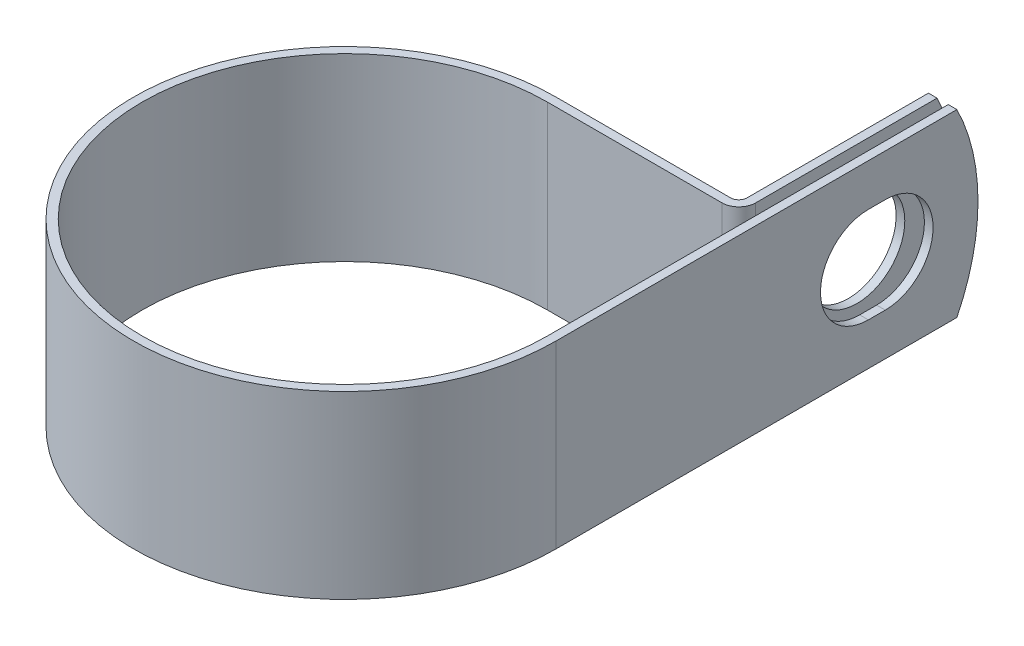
ISO-10303-21;
HEADER;
FILE_DESCRIPTION(('STEP AP214'),'2;1');
FILE_NAME('part.step','',(''),(''),'','','');
FILE_SCHEMA(('AUTOMOTIVE_DESIGN { 1 0 10303 214 1 1 1 1 }'));
ENDSEC;
DATA;
#1=APPLICATION_CONTEXT('core data for automotive mechanical design processes');
#2=APPLICATION_PROTOCOL_DEFINITION('international standard','automotive_design',2000,#1);
#3=PRODUCT_CONTEXT('',#1,'mechanical');
#4=PRODUCT('Part','Part','',(#3));
#5=PRODUCT_RELATED_PRODUCT_CATEGORY('part','',(#4));
#6=PRODUCT_DEFINITION_FORMATION('','',#4);
#7=PRODUCT_DEFINITION_CONTEXT('part definition',#1,'design');
#8=PRODUCT_DEFINITION('design','',#6,#7);
#9=PRODUCT_DEFINITION_SHAPE('','',#8);
#10=(LENGTH_UNIT() NAMED_UNIT(*) SI_UNIT(.MILLI.,.METRE.));
#11=(NAMED_UNIT(*) PLANE_ANGLE_UNIT() SI_UNIT($,.RADIAN.));
#12=(NAMED_UNIT(*) SI_UNIT($,.STERADIAN.) SOLID_ANGLE_UNIT());
#13=UNCERTAINTY_MEASURE_WITH_UNIT(LENGTH_MEASURE(1.E-05),#10,'distance_accuracy_value','');
#14=(GEOMETRIC_REPRESENTATION_CONTEXT(3) GLOBAL_UNCERTAINTY_ASSIGNED_CONTEXT((#13)) GLOBAL_UNIT_ASSIGNED_CONTEXT((#10,
#11,#12)) REPRESENTATION_CONTEXT('',''));
#15=CARTESIAN_POINT('',(0.,0.,0.));
#16=DIRECTION('',(0.,0.,1.));
#17=DIRECTION('',(1.,0.,0.));
#18=AXIS2_PLACEMENT_3D('',#15,#16,#17);
#19=CARTESIAN_POINT('',(28.575,12.7,0.));
#20=DIRECTION('',(-1.,0.,0.));
#21=DIRECTION('',(0.,0.,1.));
#22=AXIS2_PLACEMENT_3D('',#19,#20,#21);
#23=PLANE('',#22);
#24=DIRECTION('',(0.,0.,-1.));
#25=VECTOR('',#24,1.);
#26=CARTESIAN_POINT('',(28.575,-6.7437,-44.0435999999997));
#27=LINE('',#26,#25);
#28=CARTESIAN_POINT('',(28.575,-6.7437,-44.0435999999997));
#29=VERTEX_POINT('',#28);
#30=CARTESIAN_POINT('',(28.575,-6.7437,-46.4312000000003));
#31=VERTEX_POINT('',#30);
#32=EDGE_CURVE('E236',#29,#31,#27,.T.);
#33=ORIENTED_EDGE('',*,*,#32,.T.);
#34=CARTESIAN_POINT('',(28.575,0.,-46.4311999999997));
#35=DIRECTION('',(-1.,0.,0.));
#36=DIRECTION('',(0.,0.,1.));
#37=AXIS2_PLACEMENT_3D('',#34,#35,#36);
#38=CIRCLE('',#37,6.7437);
#39=CARTESIAN_POINT('',(28.575,6.7437,-46.4312000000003));
#40=VERTEX_POINT('',#39);
#41=EDGE_CURVE('E257',#31,#40,#38,.F.);
#42=ORIENTED_EDGE('',*,*,#41,.T.);
#43=DIRECTION('',(0.,0.,1.));
#44=VECTOR('',#43,1.);
#45=CARTESIAN_POINT('',(28.575,6.7437,-44.0435999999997));
#46=LINE('',#45,#44);
#47=CARTESIAN_POINT('',(28.575,6.7437,-44.0435999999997));
#48=VERTEX_POINT('',#47);
#49=EDGE_CURVE('E253',#40,#48,#46,.T.);
#50=ORIENTED_EDGE('',*,*,#49,.T.);
#51=CARTESIAN_POINT('',(28.575,0.,-44.0435999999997));
#52=DIRECTION('',(-1.,0.,0.));
#53=DIRECTION('',(0.,0.,1.));
#54=AXIS2_PLACEMENT_3D('',#51,#52,#53);
#55=CIRCLE('',#54,6.7437);
#56=EDGE_CURVE('E248',#48,#29,#55,.F.);
#57=ORIENTED_EDGE('',*,*,#56,.T.);
#58=EDGE_LOOP('',(#33,#42,#50,#57));
#59=FACE_BOUND('',#58,.T.);
#60=CARTESIAN_POINT('',(28.575,0.,-30.9372));
#61=DIRECTION('',(-1.,0.,0.));
#62=DIRECTION('',(0.,0.,1.));
#63=AXIS2_PLACEMENT_3D('',#60,#61,#62);
#64=CIRCLE('',#63,28.575);
#65=CARTESIAN_POINT('',(28.575,12.7,-56.5348683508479));
#66=VERTEX_POINT('',#65);
#67=CARTESIAN_POINT('',(28.575,-12.7,-56.5348683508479));
#68=VERTEX_POINT('',#67);
#69=EDGE_CURVE('E75',#66,#68,#64,.T.);
#70=ORIENTED_EDGE('',*,*,#69,.T.);
#71=DIRECTION('',(0.,0.,-1.));
#72=VECTOR('',#71,1.);
#73=CARTESIAN_POINT('',(28.575,-12.7,0.));
#74=LINE('',#73,#72);
#75=CARTESIAN_POINT('',(28.575,-12.7,0.));
#76=VERTEX_POINT('',#75);
#77=EDGE_CURVE('E271',#76,#68,#74,.T.);
#78=ORIENTED_EDGE('',*,*,#77,.F.);
#79=DIRECTION('',(0.,-1.,0.));
#80=VECTOR('',#79,1.);
#81=CARTESIAN_POINT('',(28.575,12.7,0.));
#82=LINE('',#81,#80);
#83=CARTESIAN_POINT('',(28.575,12.7,0.));
#84=VERTEX_POINT('',#83);
#85=EDGE_CURVE('E218',#84,#76,#82,.T.);
#86=ORIENTED_EDGE('',*,*,#85,.F.);
#87=DIRECTION('',(0.,0.,-1.));
#88=VECTOR('',#87,1.);
#89=CARTESIAN_POINT('',(28.575,12.7,-28.575));
#90=LINE('',#89,#88);
#91=EDGE_CURVE('E273',#84,#66,#90,.T.);
#92=ORIENTED_EDGE('',*,*,#91,.T.);
#93=EDGE_LOOP('',(#70,#78,#86,#92));
#94=FACE_BOUND('',#93,.T.);
#95=ADVANCED_FACE('F54',(#59,#94),#23,.T.);
#96=CARTESIAN_POINT('',(27.0002,12.7,-59.5122));
#97=DIRECTION('',(1.,0.,0.));
#98=DIRECTION('',(0.,0.,-1.));
#99=AXIS2_PLACEMENT_3D('',#96,#97,#98);
#100=PLANE('',#99);
#101=CARTESIAN_POINT('',(27.0002,0.,-45.2374));
#102=DIRECTION('',(1.,0.,0.));
#103=DIRECTION('',(0.,0.,-1.));
#104=AXIS2_PLACEMENT_3D('',#101,#102,#103);
#105=CIRCLE('',#104,6.7437);
#106=CARTESIAN_POINT('',(27.0002,0.,-51.9811));
#107=VERTEX_POINT('',#106);
#108=EDGE_CURVE('E268',#107,#107,#105,.F.);
#109=ORIENTED_EDGE('',*,*,#108,.T.);
#110=EDGE_LOOP('',(#109));
#111=FACE_BOUND('',#110,.T.);
#112=DIRECTION('',(0.,0.,1.));
#113=VECTOR('',#112,1.);
#114=CARTESIAN_POINT('',(27.0002,-12.7,-59.5122));
#115=LINE('',#114,#113);
#116=CARTESIAN_POINT('',(27.0002,-12.7,-56.5348683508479));
#117=VERTEX_POINT('',#116);
#118=CARTESIAN_POINT('',(27.0002,-12.7,-30.95244));
#119=VERTEX_POINT('',#118);
#120=EDGE_CURVE('E184',#117,#119,#115,.T.);
#121=ORIENTED_EDGE('',*,*,#120,.F.);
#122=CARTESIAN_POINT('',(27.0002,0.,-30.9372));
#123=DIRECTION('',(1.,0.,0.));
#124=DIRECTION('',(0.,0.,-1.));
#125=AXIS2_PLACEMENT_3D('',#122,#123,#124);
#126=CIRCLE('',#125,28.575);
#127=CARTESIAN_POINT('',(27.0002,12.7,-56.5348683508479));
#128=VERTEX_POINT('',#127);
#129=EDGE_CURVE('E176',#117,#128,#126,.T.);
#130=ORIENTED_EDGE('',*,*,#129,.T.);
#131=DIRECTION('',(0.,0.,1.));
#132=VECTOR('',#131,1.);
#133=CARTESIAN_POINT('',(27.0002,12.7,-59.5122));
#134=LINE('',#133,#132);
#135=CARTESIAN_POINT('',(27.0002,12.7,-30.95244));
#136=VERTEX_POINT('',#135);
#137=EDGE_CURVE('E224',#128,#136,#134,.T.);
#138=ORIENTED_EDGE('',*,*,#137,.T.);
#139=DIRECTION('',(0.,-1.,0.));
#140=VECTOR('',#139,1.);
#141=CARTESIAN_POINT('',(27.0002,12.7,-30.95244));
#142=LINE('',#141,#140);
#143=EDGE_CURVE('E211',#136,#119,#142,.T.);
#144=ORIENTED_EDGE('',*,*,#143,.T.);
#145=EDGE_LOOP('',(#121,#130,#138,#144));
#146=FACE_BOUND('',#145,.T.);
#147=ADVANCED_FACE('F226',(#111,#146),#100,.T.);
#148=CARTESIAN_POINT('',(25.781,12.7,-59.5122));
#149=DIRECTION('',(1.,0.,0.));
#150=DIRECTION('',(0.,0.,-1.));
#151=AXIS2_PLACEMENT_3D('',#148,#149,#150);
#152=PLANE('',#151);
#153=CARTESIAN_POINT('',(25.781,0.,-45.2374));
#154=DIRECTION('',(-1.,0.,0.));
#155=DIRECTION('',(0.,0.,1.));
#156=AXIS2_PLACEMENT_3D('',#153,#154,#155);
#157=CIRCLE('',#156,6.7437);
#158=CARTESIAN_POINT('',(25.781,0.,-38.4937));
#159=VERTEX_POINT('',#158);
#160=EDGE_CURVE('E265',#159,#159,#157,.T.);
#161=ORIENTED_EDGE('',*,*,#160,.F.);
#162=EDGE_LOOP('',(#161));
#163=FACE_BOUND('',#162,.T.);
#164=CARTESIAN_POINT('',(25.781,0.,-30.9372));
#165=DIRECTION('',(-1.,0.,0.));
#166=DIRECTION('',(0.,0.,1.));
#167=AXIS2_PLACEMENT_3D('',#164,#165,#166);
#168=CIRCLE('',#167,28.575);
#169=CARTESIAN_POINT('',(25.781,12.7,-56.5348683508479));
#170=VERTEX_POINT('',#169);
#171=CARTESIAN_POINT('',(25.781,-12.7,-56.5348683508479));
#172=VERTEX_POINT('',#171);
#173=EDGE_CURVE('E67',#170,#172,#168,.T.);
#174=ORIENTED_EDGE('',*,*,#173,.T.);
#175=DIRECTION('',(0.,0.,1.));
#176=VECTOR('',#175,1.);
#177=CARTESIAN_POINT('',(25.781,-12.7,-59.5122));
#178=LINE('',#177,#176);
#179=CARTESIAN_POINT('',(25.781,-12.7,-30.95244));
#180=VERTEX_POINT('',#179);
#181=EDGE_CURVE('E167',#172,#180,#178,.T.);
#182=ORIENTED_EDGE('',*,*,#181,.T.);
#183=DIRECTION('',(0.,-1.,0.));
#184=VECTOR('',#183,1.);
#185=CARTESIAN_POINT('',(25.781,12.7,-30.95244));
#186=LINE('',#185,#184);
#187=CARTESIAN_POINT('',(25.781,12.7,-30.95244));
#188=VERTEX_POINT('',#187);
#189=EDGE_CURVE('E209',#188,#180,#186,.T.);
#190=ORIENTED_EDGE('',*,*,#189,.F.);
#191=DIRECTION('',(0.,0.,1.));
#192=VECTOR('',#191,1.);
#193=CARTESIAN_POINT('',(25.781,12.7,-59.5122));
#194=LINE('',#193,#192);
#195=EDGE_CURVE('E169',#170,#188,#194,.T.);
#196=ORIENTED_EDGE('',*,*,#195,.F.);
#197=EDGE_LOOP('',(#174,#182,#190,#196));
#198=FACE_BOUND('',#197,.T.);
#199=ADVANCED_FACE('F164',(#163,#198),#152,.F.);
#200=CARTESIAN_POINT('',(29.7942,12.7,0.));
#201=DIRECTION('',(-1.,0.,0.));
#202=DIRECTION('',(0.,0.,1.));
#203=AXIS2_PLACEMENT_3D('',#200,#201,#202);
#204=PLANE('',#203);
#205=CARTESIAN_POINT('',(29.7942,0.,-46.4311999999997));
#206=DIRECTION('',(1.,0.,0.));
#207=DIRECTION('',(0.,0.,-1.));
#208=AXIS2_PLACEMENT_3D('',#205,#206,#207);
#209=CIRCLE('',#208,6.7437);
#210=CARTESIAN_POINT('',(29.7942,-6.7437,-46.4312000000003));
#211=VERTEX_POINT('',#210);
#212=CARTESIAN_POINT('',(29.7942,6.7437,-46.4312000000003));
#213=VERTEX_POINT('',#212);
#214=EDGE_CURVE('E237',#211,#213,#209,.T.);
#215=ORIENTED_EDGE('',*,*,#214,.F.);
#216=DIRECTION('',(0.,0.,-1.));
#217=VECTOR('',#216,1.);
#218=CARTESIAN_POINT('',(29.7942,-6.7437,-44.0435999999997));
#219=LINE('',#218,#217);
#220=CARTESIAN_POINT('',(29.7942,-6.7437,-44.0435999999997));
#221=VERTEX_POINT('',#220);
#222=EDGE_CURVE('E240',#221,#211,#219,.T.);
#223=ORIENTED_EDGE('',*,*,#222,.F.);
#224=CARTESIAN_POINT('',(29.7942,0.,-44.0435999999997));
#225=DIRECTION('',(1.,0.,0.));
#226=DIRECTION('',(0.,0.,-1.));
#227=AXIS2_PLACEMENT_3D('',#224,#225,#226);
#228=CIRCLE('',#227,6.7437);
#229=CARTESIAN_POINT('',(29.7942,6.7437,-44.0435999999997));
#230=VERTEX_POINT('',#229);
#231=EDGE_CURVE('E230',#230,#221,#228,.T.);
#232=ORIENTED_EDGE('',*,*,#231,.F.);
#233=DIRECTION('',(0.,0.,1.));
#234=VECTOR('',#233,1.);
#235=CARTESIAN_POINT('',(29.7942,6.7437,-44.0435999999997));
#236=LINE('',#235,#234);
#237=EDGE_CURVE('E234',#213,#230,#236,.T.);
#238=ORIENTED_EDGE('',*,*,#237,.F.);
#239=EDGE_LOOP('',(#215,#223,#232,#238));
#240=FACE_BOUND('',#239,.T.);
#241=DIRECTION('',(0.,0.,-1.));
#242=VECTOR('',#241,1.);
#243=CARTESIAN_POINT('',(29.7942,-12.7,0.));
#244=LINE('',#243,#242);
#245=CARTESIAN_POINT('',(29.7942,-12.7,0.));
#246=VERTEX_POINT('',#245);
#247=CARTESIAN_POINT('',(29.7942,-12.7,-56.5348683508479));
#248=VERTEX_POINT('',#247);
#249=EDGE_CURVE('E195',#246,#248,#244,.T.);
#250=ORIENTED_EDGE('',*,*,#249,.T.);
#251=CARTESIAN_POINT('',(29.7942,0.,-30.9372));
#252=DIRECTION('',(-1.,0.,0.));
#253=DIRECTION('',(0.,0.,1.));
#254=AXIS2_PLACEMENT_3D('',#251,#252,#253);
#255=CIRCLE('',#254,28.575);
#256=CARTESIAN_POINT('',(29.7942,12.7,-56.5348683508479));
#257=VERTEX_POINT('',#256);
#258=EDGE_CURVE('E170',#257,#248,#255,.T.);
#259=ORIENTED_EDGE('',*,*,#258,.F.);
#260=DIRECTION('',(0.,0.,-1.));
#261=VECTOR('',#260,1.);
#262=CARTESIAN_POINT('',(29.7942,12.7,-28.575));
#263=LINE('',#262,#261);
#264=CARTESIAN_POINT('',(29.7942,12.7,0.));
#265=VERTEX_POINT('',#264);
#266=EDGE_CURVE('E198',#265,#257,#263,.T.);
#267=ORIENTED_EDGE('',*,*,#266,.F.);
#268=DIRECTION('',(0.,-1.,0.));
#269=VECTOR('',#268,1.);
#270=CARTESIAN_POINT('',(29.7942,12.7,0.));
#271=LINE('',#270,#269);
#272=EDGE_CURVE('E199',#265,#246,#271,.T.);
#273=ORIENTED_EDGE('',*,*,#272,.T.);
#274=EDGE_LOOP('',(#250,#259,#267,#273));
#275=FACE_BOUND('',#274,.T.);
#276=ADVANCED_FACE('F321',(#240,#275),#204,.F.);
#277=CARTESIAN_POINT('',(0.,-12.7,0.));
#278=DIRECTION('',(0.,1.,0.));
#279=DIRECTION('',(1.,0.,0.));
#280=AXIS2_PLACEMENT_3D('',#277,#278,#279);
#281=PLANE('',#280);
#282=DIRECTION('',(-1.,0.,0.));
#283=VECTOR('',#282,1.);
#284=CARTESIAN_POINT('',(29.7942,-12.7,-56.5348683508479));
#285=LINE('',#284,#283);
#286=EDGE_CURVE('E171',#248,#68,#285,.T.);
#287=ORIENTED_EDGE('',*,*,#286,.F.);
#288=ORIENTED_EDGE('',*,*,#249,.F.);
#289=CARTESIAN_POINT('',(0.,-12.7,0.));
#290=DIRECTION('',(0.,1.,0.));
#291=DIRECTION('',(1.,0.,0.));
#292=AXIS2_PLACEMENT_3D('',#289,#290,#291);
#293=CIRCLE('',#292,29.7942);
#294=CARTESIAN_POINT('',(0.,-12.7,-29.7942));
#295=VERTEX_POINT('',#294);
#296=EDGE_CURVE('E193',#295,#246,#293,.T.);
#297=ORIENTED_EDGE('',*,*,#296,.F.);
#298=DIRECTION('',(1.,0.,0.));
#299=VECTOR('',#298,1.);
#300=CARTESIAN_POINT('',(0.,-12.7,-29.7942));
#301=LINE('',#300,#299);
#302=CARTESIAN_POINT('',(24.62276,-12.7,-29.7942));
#303=VERTEX_POINT('',#302);
#304=EDGE_CURVE('E186',#303,#295,#301,.F.);
#305=ORIENTED_EDGE('',*,*,#304,.F.);
#306=CARTESIAN_POINT('',(24.62276,-12.7,-30.95244));
#307=DIRECTION('',(0.,1.,0.));
#308=DIRECTION('',(1.,0.,0.));
#309=AXIS2_PLACEMENT_3D('',#306,#307,#308);
#310=CIRCLE('',#309,1.15824);
#311=EDGE_CURVE('E183',#180,#303,#310,.F.);
#312=ORIENTED_EDGE('',*,*,#311,.F.);
#313=ORIENTED_EDGE('',*,*,#181,.F.);
#314=DIRECTION('',(-1.,0.,0.));
#315=VECTOR('',#314,1.);
#316=CARTESIAN_POINT('',(29.7942,-12.7,-56.5348683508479));
#317=LINE('',#316,#315);
#318=EDGE_CURVE('E12',#117,#172,#317,.T.);
#319=ORIENTED_EDGE('',*,*,#318,.F.);
#320=ORIENTED_EDGE('',*,*,#120,.T.);
#321=CARTESIAN_POINT('',(24.62276,-12.7,-30.95244));
#322=DIRECTION('',(0.,-1.,0.));
#323=DIRECTION('',(0.,0.,1.));
#324=AXIS2_PLACEMENT_3D('',#321,#322,#323);
#325=CIRCLE('',#324,2.37744);
#326=CARTESIAN_POINT('',(24.62276,-12.7,-28.575));
#327=VERTEX_POINT('',#326);
#328=EDGE_CURVE('E188',#119,#327,#325,.T.);
#329=ORIENTED_EDGE('',*,*,#328,.T.);
#330=DIRECTION('',(-1.,0.,0.));
#331=VECTOR('',#330,1.);
#332=CARTESIAN_POINT('',(0.,-12.7,-28.575));
#333=LINE('',#332,#331);
#334=CARTESIAN_POINT('',(0.,-12.7,-28.575));
#335=VERTEX_POINT('',#334);
#336=EDGE_CURVE('E298',#327,#335,#333,.T.);
#337=ORIENTED_EDGE('',*,*,#336,.T.);
#338=CARTESIAN_POINT('',(0.,-12.7,0.));
#339=DIRECTION('',(0.,1.,0.));
#340=DIRECTION('',(0.,0.,1.));
#341=AXIS2_PLACEMENT_3D('',#338,#339,#340);
#342=CIRCLE('',#341,28.575);
#343=EDGE_CURVE('E295',#335,#76,#342,.T.);
#344=ORIENTED_EDGE('',*,*,#343,.T.);
#345=ORIENTED_EDGE('',*,*,#77,.T.);
#346=EDGE_LOOP('',(#287,#288,#297,#305,#312,#313,#319,#320,#329,#337,#344,#345));
#347=FACE_BOUND('',#346,.T.);
#348=ADVANCED_FACE('F181',(#347),#281,.F.);
#349=CARTESIAN_POINT('',(0.,12.7,0.));
#350=DIRECTION('',(0.,1.,0.));
#351=DIRECTION('',(1.,0.,0.));
#352=AXIS2_PLACEMENT_3D('',#349,#350,#351);
#353=PLANE('',#352);
#354=ORIENTED_EDGE('',*,*,#266,.T.);
#355=DIRECTION('',(-1.,0.,0.));
#356=VECTOR('',#355,1.);
#357=CARTESIAN_POINT('',(29.7942,12.7,-56.5348683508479));
#358=LINE('',#357,#356);
#359=EDGE_CURVE('E228',#257,#66,#358,.T.);
#360=ORIENTED_EDGE('',*,*,#359,.T.);
#361=ORIENTED_EDGE('',*,*,#91,.F.);
#362=CARTESIAN_POINT('',(0.,12.7,0.));
#363=DIRECTION('',(0.,1.,0.));
#364=DIRECTION('',(0.,0.,1.));
#365=AXIS2_PLACEMENT_3D('',#362,#363,#364);
#366=CIRCLE('',#365,28.575);
#367=CARTESIAN_POINT('',(0.,12.7,-28.575));
#368=VERTEX_POINT('',#367);
#369=EDGE_CURVE('E276',#368,#84,#366,.T.);
#370=ORIENTED_EDGE('',*,*,#369,.F.);
#371=DIRECTION('',(-1.,0.,0.));
#372=VECTOR('',#371,1.);
#373=CARTESIAN_POINT('',(0.,12.7,-28.575));
#374=LINE('',#373,#372);
#375=CARTESIAN_POINT('',(24.62276,12.7,-28.575));
#376=VERTEX_POINT('',#375);
#377=EDGE_CURVE('E279',#376,#368,#374,.T.);
#378=ORIENTED_EDGE('',*,*,#377,.F.);
#379=CARTESIAN_POINT('',(24.62276,12.7,-30.95244));
#380=DIRECTION('',(0.,-1.,0.));
#381=DIRECTION('',(0.,0.,1.));
#382=AXIS2_PLACEMENT_3D('',#379,#380,#381);
#383=CIRCLE('',#382,2.37744);
#384=EDGE_CURVE('E282',#136,#376,#383,.T.);
#385=ORIENTED_EDGE('',*,*,#384,.F.);
#386=ORIENTED_EDGE('',*,*,#137,.F.);
#387=DIRECTION('',(-1.,0.,0.));
#388=VECTOR('',#387,1.);
#389=CARTESIAN_POINT('',(29.7942,12.7,-56.5348683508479));
#390=LINE('',#389,#388);
#391=EDGE_CURVE('E61',#128,#170,#390,.T.);
#392=ORIENTED_EDGE('',*,*,#391,.T.);
#393=ORIENTED_EDGE('',*,*,#195,.T.);
#394=CARTESIAN_POINT('',(24.62276,12.7,-30.95244));
#395=DIRECTION('',(0.,1.,0.));
#396=DIRECTION('',(1.,0.,0.));
#397=AXIS2_PLACEMENT_3D('',#394,#395,#396);
#398=CIRCLE('',#397,1.15824);
#399=CARTESIAN_POINT('',(24.62276,12.7,-29.7942));
#400=VERTEX_POINT('',#399);
#401=EDGE_CURVE('E287',#188,#400,#398,.F.);
#402=ORIENTED_EDGE('',*,*,#401,.T.);
#403=DIRECTION('',(1.,0.,0.));
#404=VECTOR('',#403,1.);
#405=CARTESIAN_POINT('',(0.,12.7,-29.7942));
#406=LINE('',#405,#404);
#407=CARTESIAN_POINT('',(0.,12.7,-29.7942));
#408=VERTEX_POINT('',#407);
#409=EDGE_CURVE('E289',#400,#408,#406,.F.);
#410=ORIENTED_EDGE('',*,*,#409,.T.);
#411=CARTESIAN_POINT('',(0.,12.7,0.));
#412=DIRECTION('',(0.,1.,0.));
#413=DIRECTION('',(1.,0.,0.));
#414=AXIS2_PLACEMENT_3D('',#411,#412,#413);
#415=CIRCLE('',#414,29.7942);
#416=EDGE_CURVE('E203',#408,#265,#415,.T.);
#417=ORIENTED_EDGE('',*,*,#416,.T.);
#418=EDGE_LOOP('',(#354,#360,#361,#370,#378,#385,#386,#392,#393,#402,#410,#417));
#419=FACE_BOUND('',#418,.T.);
#420=ADVANCED_FACE('F222',(#419),#353,.T.);
#421=CARTESIAN_POINT('',(0.,12.7,0.));
#422=DIRECTION('',(0.,-1.,0.));
#423=DIRECTION('',(0.,0.,-1.));
#424=AXIS2_PLACEMENT_3D('',#421,#422,#423);
#425=CYLINDRICAL_SURFACE('',#424,28.575);
#426=ORIENTED_EDGE('',*,*,#343,.F.);
#427=DIRECTION('',(0.,-1.,0.));
#428=VECTOR('',#427,1.);
#429=CARTESIAN_POINT('',(0.,12.7,-28.575));
#430=LINE('',#429,#428);
#431=EDGE_CURVE('E216',#368,#335,#430,.T.);
#432=ORIENTED_EDGE('',*,*,#431,.F.);
#433=ORIENTED_EDGE('',*,*,#369,.T.);
#434=ORIENTED_EDGE('',*,*,#85,.T.);
#435=EDGE_LOOP('',(#426,#432,#433,#434));
#436=FACE_BOUND('',#435,.T.);
#437=ADVANCED_FACE('F311',(#436),#425,.F.);
#438=CARTESIAN_POINT('',(0.,12.7,-28.575));
#439=DIRECTION('',(0.,0.,1.));
#440=DIRECTION('',(1.,0.,0.));
#441=AXIS2_PLACEMENT_3D('',#438,#439,#440);
#442=PLANE('',#441);
#443=ORIENTED_EDGE('',*,*,#336,.F.);
#444=DIRECTION('',(0.,-1.,0.));
#445=VECTOR('',#444,1.);
#446=CARTESIAN_POINT('',(24.62276,12.7,-28.575));
#447=LINE('',#446,#445);
#448=EDGE_CURVE('E214',#376,#327,#447,.T.);
#449=ORIENTED_EDGE('',*,*,#448,.F.);
#450=ORIENTED_EDGE('',*,*,#377,.T.);
#451=ORIENTED_EDGE('',*,*,#431,.T.);
#452=EDGE_LOOP('',(#443,#449,#450,#451));
#453=FACE_BOUND('',#452,.T.);
#454=ADVANCED_FACE('F307',(#453),#442,.T.);
#455=CARTESIAN_POINT('',(24.62276,12.7,-30.95244));
#456=DIRECTION('',(0.,-1.,0.));
#457=DIRECTION('',(0.,0.,-1.));
#458=AXIS2_PLACEMENT_3D('',#455,#456,#457);
#459=CYLINDRICAL_SURFACE('',#458,2.37744);
#460=ORIENTED_EDGE('',*,*,#328,.F.);
#461=ORIENTED_EDGE('',*,*,#143,.F.);
#462=ORIENTED_EDGE('',*,*,#384,.T.);
#463=ORIENTED_EDGE('',*,*,#448,.T.);
#464=EDGE_LOOP('',(#460,#461,#462,#463));
#465=FACE_BOUND('',#464,.T.);
#466=ADVANCED_FACE('F304',(#465),#459,.T.);
#467=CARTESIAN_POINT('',(24.62276,12.7,-30.95244));
#468=DIRECTION('',(0.,-1.,0.));
#469=DIRECTION('',(0.,0.,-1.));
#470=AXIS2_PLACEMENT_3D('',#467,#468,#469);
#471=CYLINDRICAL_SURFACE('',#470,1.15824);
#472=ORIENTED_EDGE('',*,*,#311,.T.);
#473=DIRECTION('',(0.,-1.,0.));
#474=VECTOR('',#473,1.);
#475=CARTESIAN_POINT('',(24.62276,12.7,-29.7942));
#476=LINE('',#475,#474);
#477=EDGE_CURVE('E206',#400,#303,#476,.T.);
#478=ORIENTED_EDGE('',*,*,#477,.F.);
#479=ORIENTED_EDGE('',*,*,#401,.F.);
#480=ORIENTED_EDGE('',*,*,#189,.T.);
#481=EDGE_LOOP('',(#472,#478,#479,#480));
#482=FACE_BOUND('',#481,.T.);
#483=ADVANCED_FACE('F334',(#482),#471,.F.);
#484=CARTESIAN_POINT('',(0.,12.7,-29.7942));
#485=DIRECTION('',(0.,0.,1.));
#486=DIRECTION('',(1.,0.,0.));
#487=AXIS2_PLACEMENT_3D('',#484,#485,#486);
#488=PLANE('',#487);
#489=ORIENTED_EDGE('',*,*,#304,.T.);
#490=DIRECTION('',(0.,-1.,0.));
#491=VECTOR('',#490,1.);
#492=CARTESIAN_POINT('',(0.,12.7,-29.7942));
#493=LINE('',#492,#491);
#494=EDGE_CURVE('E202',#408,#295,#493,.T.);
#495=ORIENTED_EDGE('',*,*,#494,.F.);
#496=ORIENTED_EDGE('',*,*,#409,.F.);
#497=ORIENTED_EDGE('',*,*,#477,.T.);
#498=EDGE_LOOP('',(#489,#495,#496,#497));
#499=FACE_BOUND('',#498,.T.);
#500=ADVANCED_FACE('F330',(#499),#488,.F.);
#501=CARTESIAN_POINT('',(0.,12.7,0.));
#502=DIRECTION('',(0.,-1.,0.));
#503=DIRECTION('',(0.,0.,-1.));
#504=AXIS2_PLACEMENT_3D('',#501,#502,#503);
#505=CYLINDRICAL_SURFACE('',#504,29.7942);
#506=ORIENTED_EDGE('',*,*,#296,.T.);
#507=ORIENTED_EDGE('',*,*,#272,.F.);
#508=ORIENTED_EDGE('',*,*,#416,.F.);
#509=ORIENTED_EDGE('',*,*,#494,.T.);
#510=EDGE_LOOP('',(#506,#507,#508,#509));
#511=FACE_BOUND('',#510,.T.);
#512=ADVANCED_FACE('F327',(#511),#505,.T.);
#513=CARTESIAN_POINT('',(46.0742640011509,0.,-45.2374));
#514=DIRECTION('',(-1.,0.,0.));
#515=DIRECTION('',(0.,0.,1.));
#516=AXIS2_PLACEMENT_3D('',#513,#514,#515);
#517=CYLINDRICAL_SURFACE('',#516,6.7437);
#518=ORIENTED_EDGE('',*,*,#160,.T.);
#519=EDGE_LOOP('',(#518));
#520=FACE_BOUND('',#519,.T.);
#521=ORIENTED_EDGE('',*,*,#108,.F.);
#522=EDGE_LOOP('',(#521));
#523=FACE_BOUND('',#522,.T.);
#524=ADVANCED_FACE('F379',(#520,#523),#517,.F.);
#525=CARTESIAN_POINT('',(7.7441194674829,-6.7437,-44.0435999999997));
#526=DIRECTION('',(0.,-1.,0.));
#527=DIRECTION('',(0.,0.,-1.));
#528=AXIS2_PLACEMENT_3D('',#525,#526,#527);
#529=PLANE('',#528);
#530=DIRECTION('',(1.,0.,0.));
#531=VECTOR('',#530,1.);
#532=CARTESIAN_POINT('',(7.7441194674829,-6.7437,-44.0435999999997));
#533=LINE('',#532,#531);
#534=EDGE_CURVE('E251',#29,#221,#533,.T.);
#535=ORIENTED_EDGE('',*,*,#534,.T.);
#536=ORIENTED_EDGE('',*,*,#222,.T.);
#537=DIRECTION('',(1.,0.,0.));
#538=VECTOR('',#537,1.);
#539=CARTESIAN_POINT('',(7.7441194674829,-6.7437,-46.4312000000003));
#540=LINE('',#539,#538);
#541=EDGE_CURVE('E247',#31,#211,#540,.T.);
#542=ORIENTED_EDGE('',*,*,#541,.F.);
#543=ORIENTED_EDGE('',*,*,#32,.F.);
#544=EDGE_LOOP('',(#535,#536,#542,#543));
#545=FACE_BOUND('',#544,.T.);
#546=ADVANCED_FACE('F354',(#545),#529,.F.);
#547=CARTESIAN_POINT('',(7.7441194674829,0.,-46.4311999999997));
#548=DIRECTION('',(1.,0.,0.));
#549=DIRECTION('',(0.,0.,-1.));
#550=AXIS2_PLACEMENT_3D('',#547,#548,#549);
#551=CYLINDRICAL_SURFACE('',#550,6.7437);
#552=ORIENTED_EDGE('',*,*,#541,.T.);
#553=ORIENTED_EDGE('',*,*,#214,.T.);
#554=DIRECTION('',(1.,0.,0.));
#555=VECTOR('',#554,1.);
#556=CARTESIAN_POINT('',(7.7441194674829,6.7437,-46.4312000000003));
#557=LINE('',#556,#555);
#558=EDGE_CURVE('E256',#40,#213,#557,.T.);
#559=ORIENTED_EDGE('',*,*,#558,.F.);
#560=ORIENTED_EDGE('',*,*,#41,.F.);
#561=EDGE_LOOP('',(#552,#553,#559,#560));
#562=FACE_BOUND('',#561,.T.);
#563=ADVANCED_FACE('F358',(#562),#551,.F.);
#564=CARTESIAN_POINT('',(7.7441194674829,6.7437,-44.0435999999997));
#565=DIRECTION('',(0.,1.,0.));
#566=DIRECTION('',(0.,0.,1.));
#567=AXIS2_PLACEMENT_3D('',#564,#565,#566);
#568=PLANE('',#567);
#569=ORIENTED_EDGE('',*,*,#558,.T.);
#570=ORIENTED_EDGE('',*,*,#237,.T.);
#571=DIRECTION('',(1.,0.,0.));
#572=VECTOR('',#571,1.);
#573=CARTESIAN_POINT('',(7.7441194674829,6.7437,-44.0435999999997));
#574=LINE('',#573,#572);
#575=EDGE_CURVE('E252',#48,#230,#574,.T.);
#576=ORIENTED_EDGE('',*,*,#575,.F.);
#577=ORIENTED_EDGE('',*,*,#49,.F.);
#578=EDGE_LOOP('',(#569,#570,#576,#577));
#579=FACE_BOUND('',#578,.T.);
#580=ADVANCED_FACE('F362',(#579),#568,.F.);
#581=CARTESIAN_POINT('',(7.7441194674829,0.,-44.0435999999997));
#582=DIRECTION('',(1.,0.,0.));
#583=DIRECTION('',(0.,0.,-1.));
#584=AXIS2_PLACEMENT_3D('',#581,#582,#583);
#585=CYLINDRICAL_SURFACE('',#584,6.7437);
#586=ORIENTED_EDGE('',*,*,#575,.T.);
#587=ORIENTED_EDGE('',*,*,#231,.T.);
#588=ORIENTED_EDGE('',*,*,#534,.F.);
#589=ORIENTED_EDGE('',*,*,#56,.F.);
#590=EDGE_LOOP('',(#586,#587,#588,#589));
#591=FACE_BOUND('',#590,.T.);
#592=ADVANCED_FACE('F366',(#591),#585,.F.);
#593=CARTESIAN_POINT('',(29.7942,0.,-30.9372));
#594=DIRECTION('',(-1.,0.,0.));
#595=DIRECTION('',(0.,0.,1.));
#596=AXIS2_PLACEMENT_3D('',#593,#594,#595);
#597=CYLINDRICAL_SURFACE('',#596,28.575);
#598=ORIENTED_EDGE('',*,*,#129,.F.);
#599=ORIENTED_EDGE('',*,*,#318,.T.);
#600=ORIENTED_EDGE('',*,*,#173,.F.);
#601=ORIENTED_EDGE('',*,*,#391,.F.);
#602=EDGE_LOOP('',(#598,#599,#600,#601));
#603=FACE_BOUND('',#602,.T.);
#604=ADVANCED_FACE('F174',(#603),#597,.T.);
#605=ORIENTED_EDGE('',*,*,#359,.F.);
#606=ORIENTED_EDGE('',*,*,#258,.T.);
#607=ORIENTED_EDGE('',*,*,#286,.T.);
#608=ORIENTED_EDGE('',*,*,#69,.F.);
#609=EDGE_LOOP('',(#605,#606,#607,#608));
#610=FACE_BOUND('',#609,.T.);
#611=ADVANCED_FACE('F316',(#610),#597,.T.);
#612=CLOSED_SHELL('',(#95,#147,#199,#276,#348,#420,#437,#454,#466,#483,#500,#512,#524,#546,#563,
#580,#592,#604,#611));
#613=MANIFOLD_SOLID_BREP('B2',#612);
#614=ADVANCED_BREP_SHAPE_REPRESENTATION('',(#18,#613),#14);
#615=SHAPE_DEFINITION_REPRESENTATION(#9,#614);
ENDSEC;
END-ISO-10303-21;
